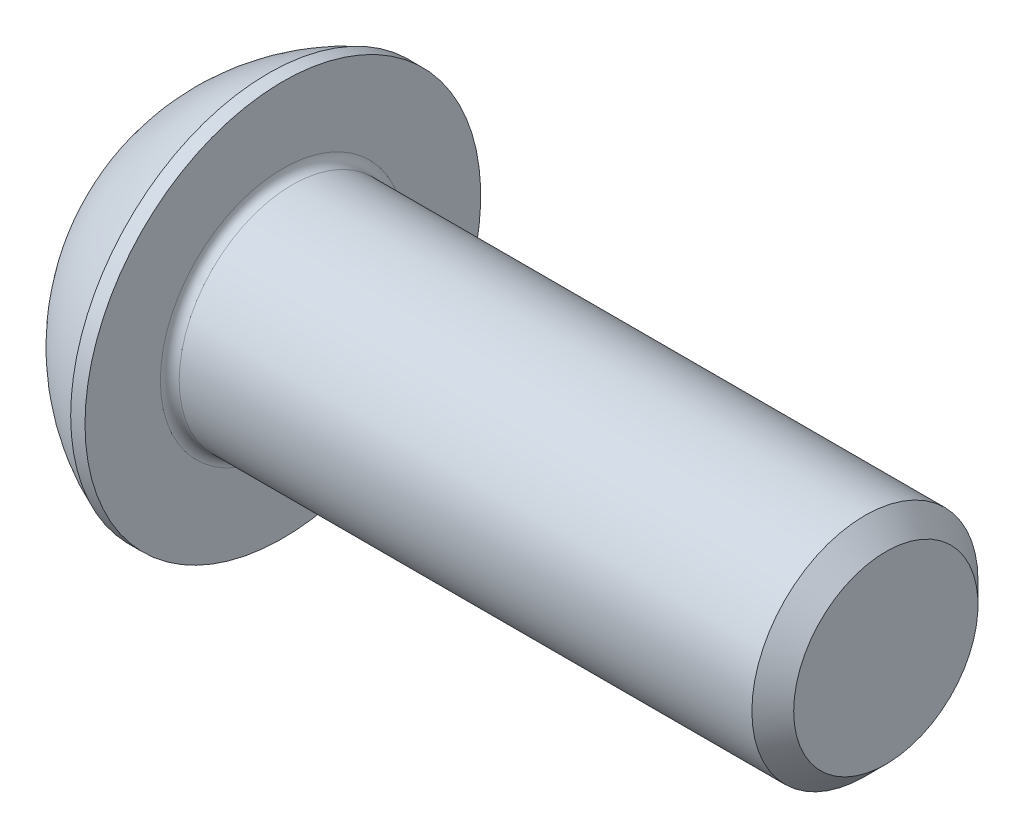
from build123d import *

# Parameters (mm, degrees)
FILLET1_R   = 0.25
HEX_2_DEPTH = 2.08


with BuildPart() as part:
    # BodySke → BaseBody (revolve)
    with BuildSketch(Plane.XY, mode=Mode.PRIVATE) as basebody_sk:
        with BuildLine():
            Line((19.3, 0), (19.3, 2.4455))
            Line((19.3, 2.4455), (18.7455, 3))
            Line((18.7455, 3), (3.3, 3))
            Line((3.3, 3), (3.3, 5.25))
            Line((3.3, 5.25), (2.92, 5.25))
            ThreePointArc((2.92, 5.25), (1.224500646, 4.199464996), (0, 2.625))
            Line((0, 2.625), (0, 0))
            Line((0, 0), (19.3, 0))
        make_face()
    revolve(basebody_sk.sketch.rotate(Axis((0, 0, 0), (1, 0, 0)), 90), axis=Axis((0, 0, 0), (1, 0, 0)))

    # Fillet1
    fillet1_edges = [part.edges().sort_by_distance(p)[0] for p in [
        (3.3, 0, -3),
    ]]
    fillet(fillet1_edges, radius=FILLET1_R)

    # Sketch2 → PreBroach (revolve, cut)
    with BuildSketch(Plane.XY, mode=Mode.PRIVATE) as prebroach_sk:
        Polygon((0, 2), (2.08, 2), (3.234700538, 0), (0, 0), align=None)
    revolve(prebroach_sk.sketch.rotate(Axis((0, 0, 0), (1, 0, 0)), 90), axis=Axis((0, 0, 0), (1, 0, 0)), mode=Mode.SUBTRACT)

    # Sketch3 → Hex 2 (cut)
    with BuildSketch(Plane(origin=(0, 0, 0), x_dir=(0, 0, -1), z_dir=(1, 0, 0))):
        Polygon((-2, -1.154700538), (-2, 1.154700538), (0, 2.309401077), (2, 1.154700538), (2, -1.154700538), (0, -2.309401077), align=None)
    extrude(amount=HEX_2_DEPTH, mode=Mode.SUBTRACT)


solid = part.part
